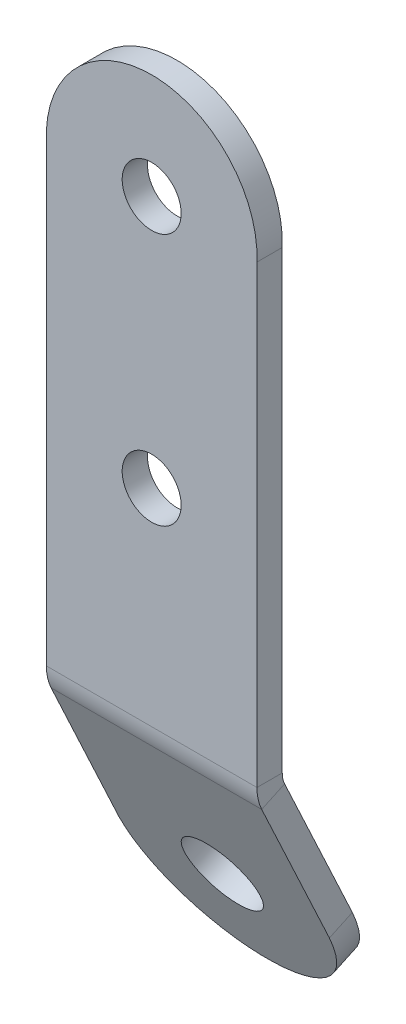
ISO-10303-21;
HEADER;
FILE_DESCRIPTION(('STEP AP214'),'2;1');
FILE_NAME('part.step','',(''),(''),'','','');
FILE_SCHEMA(('AUTOMOTIVE_DESIGN { 1 0 10303 214 1 1 1 1 }'));
ENDSEC;
DATA;
#1=APPLICATION_CONTEXT('core data for automotive mechanical design processes');
#2=APPLICATION_PROTOCOL_DEFINITION('international standard','automotive_design',2000,#1);
#3=PRODUCT_CONTEXT('',#1,'mechanical');
#4=PRODUCT('Part','Part','',(#3));
#5=PRODUCT_RELATED_PRODUCT_CATEGORY('part','',(#4));
#6=PRODUCT_DEFINITION_FORMATION('','',#4);
#7=PRODUCT_DEFINITION_CONTEXT('part definition',#1,'design');
#8=PRODUCT_DEFINITION('design','',#6,#7);
#9=PRODUCT_DEFINITION_SHAPE('','',#8);
#10=(LENGTH_UNIT() NAMED_UNIT(*) SI_UNIT(.MILLI.,.METRE.));
#11=(NAMED_UNIT(*) PLANE_ANGLE_UNIT() SI_UNIT($,.RADIAN.));
#12=(NAMED_UNIT(*) SI_UNIT($,.STERADIAN.) SOLID_ANGLE_UNIT());
#13=UNCERTAINTY_MEASURE_WITH_UNIT(LENGTH_MEASURE(1.E-05),#10,'distance_accuracy_value','');
#14=(GEOMETRIC_REPRESENTATION_CONTEXT(3) GLOBAL_UNCERTAINTY_ASSIGNED_CONTEXT((#13)) GLOBAL_UNIT_ASSIGNED_CONTEXT((#10,
#11,#12)) REPRESENTATION_CONTEXT('',''));
#15=CARTESIAN_POINT('',(0.,0.,0.));
#16=DIRECTION('',(0.,0.,1.));
#17=DIRECTION('',(1.,0.,0.));
#18=AXIS2_PLACEMENT_3D('',#15,#16,#17);
#19=CARTESIAN_POINT('',(2.50000033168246,1.66280187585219,-5.38830487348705));
#20=DIRECTION('',(0.,0.4226182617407,-0.90630778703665));
#21=DIRECTION('',(-1.,0.,0.));
#22=AXIS2_PLACEMENT_3D('',#19,#20,#21);
#23=CYLINDRICAL_SURFACE('',#22,4.5);
#24=CARTESIAN_POINT('',(2.50000033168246,1.66280187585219,-5.38830487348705));
#25=DIRECTION('',(0.,-0.4226182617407,0.90630778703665));
#26=DIRECTION('',(1.,0.,0.));
#27=AXIS2_PLACEMENT_3D('',#24,#25,#26);
#28=CIRCLE('',#27,4.5);
#29=CARTESIAN_POINT('',(7.00000033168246,1.66280187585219,-5.38830487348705));
#30=VERTEX_POINT('',#29);
#31=EDGE_CURVE('E171',#30,#30,#28,.T.);
#32=ORIENTED_EDGE('',*,*,#31,.T.);
#33=EDGE_LOOP('',(#32));
#34=FACE_BOUND('',#33,.T.);
#35=CARTESIAN_POINT('',(2.50000033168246,2.93065666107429,-8.107228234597));
#36=DIRECTION('',(0.,-0.4226182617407,0.90630778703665));
#37=DIRECTION('',(1.,0.,0.));
#38=AXIS2_PLACEMENT_3D('',#35,#36,#37);
#39=CIRCLE('',#38,4.5);
#40=CARTESIAN_POINT('',(7.00000033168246,2.93065666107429,-8.107228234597));
#41=VERTEX_POINT('',#40);
#42=EDGE_CURVE('E11',#41,#41,#39,.T.);
#43=ORIENTED_EDGE('',*,*,#42,.F.);
#44=EDGE_LOOP('',(#43));
#45=FACE_BOUND('',#44,.T.);
#46=ADVANCED_FACE('F30',(#34,#45),#23,.F.);
#47=CARTESIAN_POINT('',(2.50000033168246,1.66280187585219,-5.38830487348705));
#48=DIRECTION('',(0.,0.4226182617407,-0.90630778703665));
#49=DIRECTION('',(-1.,0.,0.));
#50=AXIS2_PLACEMENT_3D('',#47,#48,#49);
#51=CYLINDRICAL_SURFACE('',#50,12.5099963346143);
#52=CARTESIAN_POINT('',(2.50000033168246,2.93065666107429,-8.107228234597));
#53=DIRECTION('',(0.,-0.4226182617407,0.90630778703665));
#54=DIRECTION('',(1.,0.,0.));
#55=AXIS2_PLACEMENT_3D('',#52,#53,#54);
#56=CIRCLE('',#55,12.5099963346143);
#57=CARTESIAN_POINT('',(-10.,2.47750276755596,-8.31853736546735));
#58=VERTEX_POINT('',#57);
#59=CARTESIAN_POINT('',(15.,2.47748773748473,-8.31854437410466));
#60=VERTEX_POINT('',#59);
#61=EDGE_CURVE('E168',#58,#60,#56,.T.);
#62=ORIENTED_EDGE('',*,*,#61,.T.);
#63=DIRECTION('',(0.,0.4226182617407,-0.90630778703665));
#64=VECTOR('',#63,1.);
#65=CARTESIAN_POINT('',(15.,1.20963295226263,-5.59962101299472));
#66=LINE('',#65,#64);
#67=CARTESIAN_POINT('',(15.,1.20963295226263,-5.59962101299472));
#68=VERTEX_POINT('',#67);
#69=EDGE_CURVE('E161',#68,#60,#66,.T.);
#70=ORIENTED_EDGE('',*,*,#69,.F.);
#71=CARTESIAN_POINT('',(2.50000033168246,1.66280187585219,-5.38830487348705));
#72=DIRECTION('',(0.,-0.4226182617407,0.90630778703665));
#73=DIRECTION('',(1.,0.,0.));
#74=AXIS2_PLACEMENT_3D('',#71,#72,#73);
#75=CIRCLE('',#74,12.5099963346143);
#76=CARTESIAN_POINT('',(-10.,1.20964798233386,-5.5996140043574));
#77=VERTEX_POINT('',#76);
#78=EDGE_CURVE('E154',#77,#68,#75,.T.);
#79=ORIENTED_EDGE('',*,*,#78,.F.);
#80=DIRECTION('',(0.,0.4226182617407,-0.90630778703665));
#81=VECTOR('',#80,1.);
#82=CARTESIAN_POINT('',(-10.,1.20964798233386,-5.5996140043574));
#83=LINE('',#82,#81);
#84=EDGE_CURVE('E165',#77,#58,#83,.T.);
#85=ORIENTED_EDGE('',*,*,#84,.T.);
#86=EDGE_LOOP('',(#62,#70,#79,#85));
#87=FACE_BOUND('',#86,.T.);
#88=ADVANCED_FACE('F187',(#87),#51,.T.);
#89=CARTESIAN_POINT('',(15.,69.1827320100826,26.0967556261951));
#90=DIRECTION('',(1.,0.,0.));
#91=DIRECTION('',(0.,0.4226182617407,-0.90630778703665));
#92=AXIS2_PLACEMENT_3D('',#89,#90,#91);
#93=PLANE('',#92);
#94=DIRECTION('',(0.,-0.90630778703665,-0.4226182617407));
#95=VECTOR('',#94,1.);
#96=CARTESIAN_POINT('',(15.,70.4505867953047,23.3778322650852));
#97=LINE('',#96,#95);
#98=CARTESIAN_POINT('',(15.,19.7138929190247,-0.281076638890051));
#99=VERTEX_POINT('',#98);
#100=EDGE_CURVE('E40',#99,#60,#97,.T.);
#101=ORIENTED_EDGE('',*,*,#100,.F.);
#102=DIRECTION('',(0.,-0.4226182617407,0.90630778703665));
#103=VECTOR('',#102,1.);
#104=CARTESIAN_POINT('',(15.,18.4460381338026,2.4378467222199));
#105=LINE('',#104,#103);
#106=CARTESIAN_POINT('',(15.,18.4460381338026,2.4378467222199));
#107=VERTEX_POINT('',#106);
#108=EDGE_CURVE('E128',#99,#107,#105,.T.);
#109=ORIENTED_EDGE('',*,*,#108,.T.);
#110=DIRECTION('',(0.,-0.90630778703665,-0.4226182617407));
#111=VECTOR('',#110,1.);
#112=CARTESIAN_POINT('',(15.,69.1827320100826,26.0967556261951));
#113=LINE('',#112,#111);
#114=EDGE_CURVE('E63',#107,#68,#113,.T.);
#115=ORIENTED_EDGE('',*,*,#114,.T.);
#116=ORIENTED_EDGE('',*,*,#69,.T.);
#117=EDGE_LOOP('',(#101,#109,#115,#116));
#118=FACE_BOUND('',#117,.T.);
#119=ADVANCED_FACE('F194',(#118),#93,.T.);
#120=CARTESIAN_POINT('',(2.49999999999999,69.6358859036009,26.3080647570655));
#121=DIRECTION('',(0.,-0.4226182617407,0.90630778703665));
#122=DIRECTION('',(1.,0.,0.));
#123=AXIS2_PLACEMENT_3D('',#120,#121,#122);
#124=PLANE('',#123);
#125=ORIENTED_EDGE('',*,*,#31,.F.);
#126=EDGE_LOOP('',(#125));
#127=FACE_BOUND('',#126,.T.);
#128=ORIENTED_EDGE('',*,*,#114,.F.);
#129=DIRECTION('',(-1.,0.,0.));
#130=VECTOR('',#129,1.);
#131=CARTESIAN_POINT('',(2.49999999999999,18.4460381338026,2.4378467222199));
#132=LINE('',#131,#130);
#133=CARTESIAN_POINT('',(-10.,18.4460381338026,2.4378467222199));
#134=VERTEX_POINT('',#133);
#135=EDGE_CURVE('E158',#107,#134,#132,.T.);
#136=ORIENTED_EDGE('',*,*,#135,.T.);
#137=DIRECTION('',(0.,-0.90630778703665,-0.4226182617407));
#138=VECTOR('',#137,1.);
#139=CARTESIAN_POINT('',(-10.,70.0890397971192,26.5193738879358));
#140=LINE('',#139,#138);
#141=EDGE_CURVE('E156',#134,#77,#140,.T.);
#142=ORIENTED_EDGE('',*,*,#141,.T.);
#143=ORIENTED_EDGE('',*,*,#78,.T.);
#144=EDGE_LOOP('',(#128,#136,#142,#143));
#145=FACE_BOUND('',#144,.T.);
#146=ADVANCED_FACE('F190',(#127,#145),#124,.T.);
#147=CARTESIAN_POINT('',(-10.,70.0890397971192,26.5193738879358));
#148=DIRECTION('',(1.,0.,0.));
#149=DIRECTION('',(0.,0.4226182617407,-0.90630778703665));
#150=AXIS2_PLACEMENT_3D('',#147,#148,#149);
#151=PLANE('',#150);
#152=DIRECTION('',(0.,-0.4226182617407,0.90630778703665));
#153=VECTOR('',#152,1.);
#154=CARTESIAN_POINT('',(-10.,18.4460381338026,2.4378467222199));
#155=LINE('',#154,#153);
#156=CARTESIAN_POINT('',(-10.,19.7138929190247,-0.281076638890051));
#157=VERTEX_POINT('',#156);
#158=EDGE_CURVE('E173',#157,#134,#155,.T.);
#159=ORIENTED_EDGE('',*,*,#158,.F.);
#160=DIRECTION('',(0.,-0.90630778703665,-0.4226182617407));
#161=VECTOR('',#160,1.);
#162=CARTESIAN_POINT('',(-10.,71.3568945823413,23.8004505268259));
#163=LINE('',#162,#161);
#164=EDGE_CURVE('E152',#157,#58,#163,.T.);
#165=ORIENTED_EDGE('',*,*,#164,.T.);
#166=ORIENTED_EDGE('',*,*,#84,.F.);
#167=ORIENTED_EDGE('',*,*,#141,.F.);
#168=EDGE_LOOP('',(#159,#165,#166,#167));
#169=FACE_BOUND('',#168,.T.);
#170=ADVANCED_FACE('F182',(#169),#151,.F.);
#171=CARTESIAN_POINT('',(2.49999999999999,70.903740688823,23.5891413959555));
#172=DIRECTION('',(0.,-0.4226182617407,0.90630778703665));
#173=DIRECTION('',(1.,0.,0.));
#174=AXIS2_PLACEMENT_3D('',#171,#172,#173);
#175=PLANE('',#174);
#176=DIRECTION('',(-1.,0.,0.));
#177=VECTOR('',#176,1.);
#178=CARTESIAN_POINT('',(2.49999999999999,19.7138929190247,-0.281076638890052));
#179=LINE('',#178,#177);
#180=EDGE_CURVE('E34',#99,#157,#179,.T.);
#181=ORIENTED_EDGE('',*,*,#180,.F.);
#182=ORIENTED_EDGE('',*,*,#100,.T.);
#183=ORIENTED_EDGE('',*,*,#61,.F.);
#184=ORIENTED_EDGE('',*,*,#164,.F.);
#185=EDGE_LOOP('',(#181,#182,#183,#184));
#186=FACE_BOUND('',#185,.T.);
#187=ORIENTED_EDGE('',*,*,#42,.T.);
#188=EDGE_LOOP('',(#187));
#189=FACE_BOUND('',#188,.T.);
#190=ADVANCED_FACE('F32',(#186,#189),#175,.F.);
#191=CARTESIAN_POINT('',(2.49999999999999,75.5,0.));
#192=DIRECTION('',(0.,0.,1.));
#193=DIRECTION('',(1.,0.,0.));
#194=AXIS2_PLACEMENT_3D('',#191,#192,#193);
#195=PLANE('',#194);
#196=CARTESIAN_POINT('',(2.49999999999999,45.5,0.));
#197=DIRECTION('',(0.,0.,1.));
#198=DIRECTION('',(1.,0.,0.));
#199=AXIS2_PLACEMENT_3D('',#196,#197,#198);
#200=CIRCLE('',#199,3.5);
#201=CARTESIAN_POINT('',(5.99999999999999,45.5,0.));
#202=VERTEX_POINT('',#201);
#203=EDGE_CURVE('E356',#202,#202,#200,.T.);
#204=ORIENTED_EDGE('',*,*,#203,.T.);
#205=EDGE_LOOP('',(#204));
#206=FACE_BOUND('',#205,.T.);
#207=CARTESIAN_POINT('',(2.49999999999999,75.5,0.));
#208=DIRECTION('',(0.,0.,1.));
#209=DIRECTION('',(1.,0.,0.));
#210=AXIS2_PLACEMENT_3D('',#207,#208,#209);
#211=CIRCLE('',#210,3.5);
#212=CARTESIAN_POINT('',(5.99999999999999,75.5,0.));
#213=VERTEX_POINT('',#212);
#214=EDGE_CURVE('E353',#213,#213,#211,.T.);
#215=ORIENTED_EDGE('',*,*,#214,.T.);
#216=EDGE_LOOP('',(#215));
#217=FACE_BOUND('',#216,.T.);
#218=DIRECTION('',(0.,-1.,0.));
#219=VECTOR('',#218,1.);
#220=CARTESIAN_POINT('',(15.,75.,0.));
#221=LINE('',#220,#219);
#222=CARTESIAN_POINT('',(15.,75.,0.));
#223=VERTEX_POINT('',#222);
#224=CARTESIAN_POINT('',(15.,20.9817477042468,0.));
#225=VERTEX_POINT('',#224);
#226=EDGE_CURVE('E131',#223,#225,#221,.T.);
#227=ORIENTED_EDGE('',*,*,#226,.T.);
#228=DIRECTION('',(-1.,0.,0.));
#229=VECTOR('',#228,1.);
#230=CARTESIAN_POINT('',(2.49999999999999,20.9817477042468,0.));
#231=LINE('',#230,#229);
#232=CARTESIAN_POINT('',(-10.,20.9817477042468,0.));
#233=VERTEX_POINT('',#232);
#234=EDGE_CURVE('E110',#225,#233,#231,.T.);
#235=ORIENTED_EDGE('',*,*,#234,.T.);
#236=DIRECTION('',(0.,-1.,0.));
#237=VECTOR('',#236,1.);
#238=CARTESIAN_POINT('',(-10.,76.,0.));
#239=LINE('',#238,#237);
#240=CARTESIAN_POINT('',(-10.,76.,0.));
#241=VERTEX_POINT('',#240);
#242=EDGE_CURVE('E140',#241,#233,#239,.T.);
#243=ORIENTED_EDGE('',*,*,#242,.F.);
#244=CARTESIAN_POINT('',(2.49999999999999,75.5,0.));
#245=DIRECTION('',(0.,0.,1.));
#246=DIRECTION('',(1.,0.,0.));
#247=AXIS2_PLACEMENT_3D('',#244,#245,#246);
#248=CIRCLE('',#247,12.5099960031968);
#249=EDGE_CURVE('E138',#223,#241,#248,.T.);
#250=ORIENTED_EDGE('',*,*,#249,.F.);
#251=EDGE_LOOP('',(#227,#235,#243,#250));
#252=FACE_BOUND('',#251,.T.);
#253=ADVANCED_FACE('F136',(#206,#217,#252),#195,.F.);
#254=CARTESIAN_POINT('',(-10.,76.,3.));
#255=DIRECTION('',(1.,0.,0.));
#256=DIRECTION('',(0.,0.,-1.));
#257=AXIS2_PLACEMENT_3D('',#254,#255,#256);
#258=PLANE('',#257);
#259=ORIENTED_EDGE('',*,*,#242,.T.);
#260=DIRECTION('',(0.,0.,1.));
#261=VECTOR('',#260,1.);
#262=CARTESIAN_POINT('',(-10.,20.9817477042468,3.));
#263=LINE('',#262,#261);
#264=CARTESIAN_POINT('',(-10.,20.9817477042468,3.));
#265=VERTEX_POINT('',#264);
#266=EDGE_CURVE('E120',#233,#265,#263,.T.);
#267=ORIENTED_EDGE('',*,*,#266,.T.);
#268=DIRECTION('',(0.,-1.,0.));
#269=VECTOR('',#268,1.);
#270=CARTESIAN_POINT('',(-10.,76.,3.));
#271=LINE('',#270,#269);
#272=CARTESIAN_POINT('',(-10.,76.,3.));
#273=VERTEX_POINT('',#272);
#274=EDGE_CURVE('E143',#273,#265,#271,.T.);
#275=ORIENTED_EDGE('',*,*,#274,.F.);
#276=DIRECTION('',(0.,0.,-1.));
#277=VECTOR('',#276,1.);
#278=CARTESIAN_POINT('',(-10.,76.,3.));
#279=LINE('',#278,#277);
#280=EDGE_CURVE('E367',#273,#241,#279,.T.);
#281=ORIENTED_EDGE('',*,*,#280,.T.);
#282=EDGE_LOOP('',(#259,#267,#275,#281));
#283=FACE_BOUND('',#282,.T.);
#284=ADVANCED_FACE('F213',(#283),#258,.F.);
#285=CARTESIAN_POINT('',(2.49999999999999,75.5,3.));
#286=DIRECTION('',(0.,0.,1.));
#287=DIRECTION('',(1.,0.,0.));
#288=AXIS2_PLACEMENT_3D('',#285,#286,#287);
#289=PLANE('',#288);
#290=DIRECTION('',(-1.,0.,0.));
#291=VECTOR('',#290,1.);
#292=CARTESIAN_POINT('',(2.49999999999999,20.9817477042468,3.));
#293=LINE('',#292,#291);
#294=CARTESIAN_POINT('',(15.,20.9817477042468,3.));
#295=VERTEX_POINT('',#294);
#296=EDGE_CURVE('E119',#295,#265,#293,.T.);
#297=ORIENTED_EDGE('',*,*,#296,.F.);
#298=DIRECTION('',(0.,-1.,0.));
#299=VECTOR('',#298,1.);
#300=CARTESIAN_POINT('',(15.,75.,3.));
#301=LINE('',#300,#299);
#302=CARTESIAN_POINT('',(15.,75.,3.));
#303=VERTEX_POINT('',#302);
#304=EDGE_CURVE('E133',#303,#295,#301,.T.);
#305=ORIENTED_EDGE('',*,*,#304,.F.);
#306=CARTESIAN_POINT('',(2.49999999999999,75.5,3.));
#307=DIRECTION('',(0.,0.,1.));
#308=DIRECTION('',(1.,0.,0.));
#309=AXIS2_PLACEMENT_3D('',#306,#307,#308);
#310=CIRCLE('',#309,12.5099960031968);
#311=EDGE_CURVE('E139',#303,#273,#310,.T.);
#312=ORIENTED_EDGE('',*,*,#311,.T.);
#313=ORIENTED_EDGE('',*,*,#274,.T.);
#314=EDGE_LOOP('',(#297,#305,#312,#313));
#315=FACE_BOUND('',#314,.T.);
#316=CARTESIAN_POINT('',(2.49999999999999,45.5,3.));
#317=DIRECTION('',(0.,0.,1.));
#318=DIRECTION('',(1.,0.,0.));
#319=AXIS2_PLACEMENT_3D('',#316,#317,#318);
#320=CIRCLE('',#319,3.5);
#321=CARTESIAN_POINT('',(5.99999999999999,45.5,3.));
#322=VERTEX_POINT('',#321);
#323=EDGE_CURVE('E362',#322,#322,#320,.T.);
#324=ORIENTED_EDGE('',*,*,#323,.F.);
#325=EDGE_LOOP('',(#324));
#326=FACE_BOUND('',#325,.T.);
#327=CARTESIAN_POINT('',(2.49999999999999,75.5,3.));
#328=DIRECTION('',(0.,0.,1.));
#329=DIRECTION('',(1.,0.,0.));
#330=AXIS2_PLACEMENT_3D('',#327,#328,#329);
#331=CIRCLE('',#330,3.5);
#332=CARTESIAN_POINT('',(5.99999999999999,75.5,3.));
#333=VERTEX_POINT('',#332);
#334=EDGE_CURVE('E350',#333,#333,#331,.T.);
#335=ORIENTED_EDGE('',*,*,#334,.F.);
#336=EDGE_LOOP('',(#335));
#337=FACE_BOUND('',#336,.T.);
#338=ADVANCED_FACE('F217',(#315,#326,#337),#289,.T.);
#339=CARTESIAN_POINT('',(2.49999999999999,75.5,3.));
#340=DIRECTION('',(0.,0.,-1.));
#341=DIRECTION('',(-1.,0.,0.));
#342=AXIS2_PLACEMENT_3D('',#339,#340,#341);
#343=CYLINDRICAL_SURFACE('',#342,12.5099960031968);
#344=ORIENTED_EDGE('',*,*,#249,.T.);
#345=ORIENTED_EDGE('',*,*,#280,.F.);
#346=ORIENTED_EDGE('',*,*,#311,.F.);
#347=DIRECTION('',(0.,0.,-1.));
#348=VECTOR('',#347,1.);
#349=CARTESIAN_POINT('',(15.,75.,3.));
#350=LINE('',#349,#348);
#351=EDGE_CURVE('E81',#303,#223,#350,.T.);
#352=ORIENTED_EDGE('',*,*,#351,.T.);
#353=EDGE_LOOP('',(#344,#345,#346,#352));
#354=FACE_BOUND('',#353,.T.);
#355=ADVANCED_FACE('F221',(#354),#343,.T.);
#356=CARTESIAN_POINT('',(15.,75.,3.));
#357=DIRECTION('',(1.,0.,0.));
#358=DIRECTION('',(0.,0.,-1.));
#359=AXIS2_PLACEMENT_3D('',#356,#357,#358);
#360=PLANE('',#359);
#361=DIRECTION('',(0.,0.,1.));
#362=VECTOR('',#361,1.);
#363=CARTESIAN_POINT('',(15.,20.9817477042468,3.));
#364=LINE('',#363,#362);
#365=EDGE_CURVE('E126',#225,#295,#364,.T.);
#366=ORIENTED_EDGE('',*,*,#365,.F.);
#367=ORIENTED_EDGE('',*,*,#226,.F.);
#368=ORIENTED_EDGE('',*,*,#351,.F.);
#369=ORIENTED_EDGE('',*,*,#304,.T.);
#370=EDGE_LOOP('',(#366,#367,#368,#369));
#371=FACE_BOUND('',#370,.T.);
#372=ADVANCED_FACE('F130',(#371),#360,.T.);
#373=CARTESIAN_POINT('',(2.49999999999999,45.5,3.));
#374=DIRECTION('',(0.,0.,-1.));
#375=DIRECTION('',(-1.,0.,0.));
#376=AXIS2_PLACEMENT_3D('',#373,#374,#375);
#377=CYLINDRICAL_SURFACE('',#376,3.5);
#378=ORIENTED_EDGE('',*,*,#323,.T.);
#379=EDGE_LOOP('',(#378));
#380=FACE_BOUND('',#379,.T.);
#381=ORIENTED_EDGE('',*,*,#203,.F.);
#382=EDGE_LOOP('',(#381));
#383=FACE_BOUND('',#382,.T.);
#384=ADVANCED_FACE('F225',(#380,#383),#377,.F.);
#385=CARTESIAN_POINT('',(2.49999999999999,75.5,3.));
#386=DIRECTION('',(0.,0.,-1.));
#387=DIRECTION('',(-1.,0.,0.));
#388=AXIS2_PLACEMENT_3D('',#385,#386,#387);
#389=CYLINDRICAL_SURFACE('',#388,3.5);
#390=ORIENTED_EDGE('',*,*,#334,.T.);
#391=EDGE_LOOP('',(#390));
#392=FACE_BOUND('',#391,.T.);
#393=ORIENTED_EDGE('',*,*,#214,.F.);
#394=EDGE_LOOP('',(#393));
#395=FACE_BOUND('',#394,.T.);
#396=ADVANCED_FACE('F231',(#392,#395),#389,.F.);
#397=CARTESIAN_POINT('',(15.,20.9817477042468,-3.));
#398=DIRECTION('',(-1.,0.,0.));
#399=DIRECTION('',(0.,0.,1.));
#400=AXIS2_PLACEMENT_3D('',#397,#398,#399);
#401=PLANE('',#400);
#402=ORIENTED_EDGE('',*,*,#108,.F.);
#403=CARTESIAN_POINT('',(15.,20.9817477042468,-3.));
#404=DIRECTION('',(-1.,0.,0.));
#405=DIRECTION('',(0.,0.,1.));
#406=AXIS2_PLACEMENT_3D('',#403,#404,#405);
#407=CIRCLE('',#406,3.);
#408=EDGE_CURVE('E113',#225,#99,#407,.F.);
#409=ORIENTED_EDGE('',*,*,#408,.F.);
#410=ORIENTED_EDGE('',*,*,#365,.T.);
#411=CARTESIAN_POINT('',(15.,20.9817477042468,-3.));
#412=DIRECTION('',(-1.,0.,0.));
#413=DIRECTION('',(0.,0.,1.));
#414=AXIS2_PLACEMENT_3D('',#411,#412,#413);
#415=CIRCLE('',#414,6.);
#416=EDGE_CURVE('E178',#295,#107,#415,.F.);
#417=ORIENTED_EDGE('',*,*,#416,.T.);
#418=EDGE_LOOP('',(#402,#409,#410,#417));
#419=FACE_BOUND('',#418,.T.);
#420=ADVANCED_FACE('F124',(#419),#401,.F.);
#421=CARTESIAN_POINT('',(-10.,20.9817477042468,-3.));
#422=DIRECTION('',(-1.,0.,0.));
#423=DIRECTION('',(0.,0.,1.));
#424=AXIS2_PLACEMENT_3D('',#421,#422,#423);
#425=PLANE('',#424);
#426=CARTESIAN_POINT('',(-10.,20.9817477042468,-3.));
#427=DIRECTION('',(-1.,0.,0.));
#428=DIRECTION('',(0.,0.,1.));
#429=AXIS2_PLACEMENT_3D('',#426,#427,#428);
#430=CIRCLE('',#429,3.);
#431=EDGE_CURVE('E115',#233,#157,#430,.F.);
#432=ORIENTED_EDGE('',*,*,#431,.T.);
#433=ORIENTED_EDGE('',*,*,#158,.T.);
#434=CARTESIAN_POINT('',(-10.,20.9817477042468,-3.));
#435=DIRECTION('',(-1.,0.,0.));
#436=DIRECTION('',(0.,0.,1.));
#437=AXIS2_PLACEMENT_3D('',#434,#435,#436);
#438=CIRCLE('',#437,6.);
#439=EDGE_CURVE('E70',#265,#134,#438,.F.);
#440=ORIENTED_EDGE('',*,*,#439,.F.);
#441=ORIENTED_EDGE('',*,*,#266,.F.);
#442=EDGE_LOOP('',(#432,#433,#440,#441));
#443=FACE_BOUND('',#442,.T.);
#444=ADVANCED_FACE('F176',(#443),#425,.T.);
#445=CARTESIAN_POINT('',(118.143098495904,20.9817477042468,-3.));
#446=DIRECTION('',(-1.,0.,0.));
#447=DIRECTION('',(0.,0.,1.));
#448=AXIS2_PLACEMENT_3D('',#445,#446,#447);
#449=CYLINDRICAL_SURFACE('',#448,6.);
#450=ORIENTED_EDGE('',*,*,#296,.T.);
#451=ORIENTED_EDGE('',*,*,#439,.T.);
#452=ORIENTED_EDGE('',*,*,#135,.F.);
#453=ORIENTED_EDGE('',*,*,#416,.F.);
#454=EDGE_LOOP('',(#450,#451,#452,#453));
#455=FACE_BOUND('',#454,.T.);
#456=ADVANCED_FACE('F191',(#455),#449,.T.);
#457=CARTESIAN_POINT('',(118.143098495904,20.9817477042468,-3.));
#458=DIRECTION('',(-1.,0.,0.));
#459=DIRECTION('',(0.,0.,1.));
#460=AXIS2_PLACEMENT_3D('',#457,#458,#459);
#461=CYLINDRICAL_SURFACE('',#460,3.);
#462=ORIENTED_EDGE('',*,*,#234,.F.);
#463=ORIENTED_EDGE('',*,*,#408,.T.);
#464=ORIENTED_EDGE('',*,*,#180,.T.);
#465=ORIENTED_EDGE('',*,*,#431,.F.);
#466=EDGE_LOOP('',(#462,#463,#464,#465));
#467=FACE_BOUND('',#466,.T.);
#468=ADVANCED_FACE('F112',(#467),#461,.F.);
#469=CLOSED_SHELL('',(#46,#88,#119,#146,#170,#190,#253,#284,#338,#355,#372,#384,#396,#420,#444,
#456,#468));
#470=MANIFOLD_SOLID_BREP('B2',#469);
#471=ADVANCED_BREP_SHAPE_REPRESENTATION('',(#18,#470),#14);
#472=SHAPE_DEFINITION_REPRESENTATION(#9,#471);
ENDSEC;
END-ISO-10303-21;
